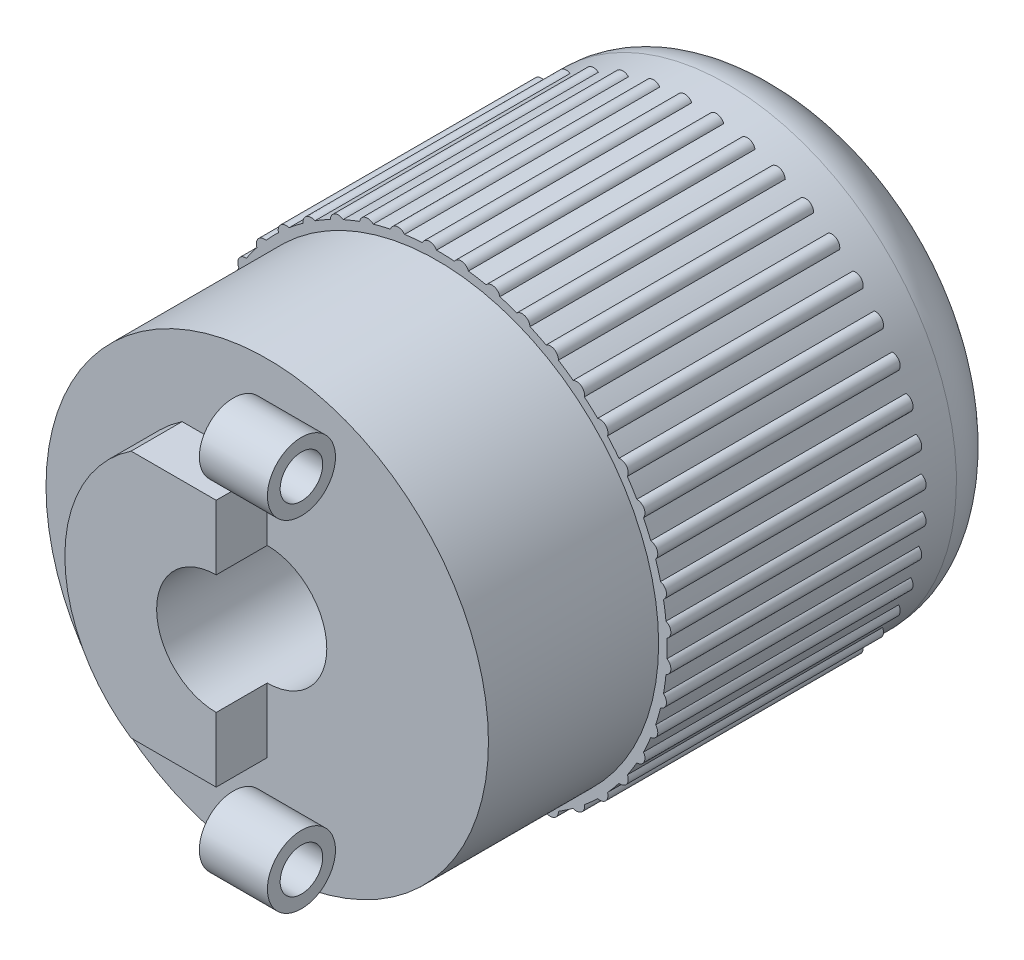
from build123d import *

# Parameters (mm, degrees)
ESQUISSE1_R                  = 13
BASE_EXTRUSION_DEPTH         = 10
ESQUISSE3_R                  = 13.5
BOSS_EXTRU_2_DEPTH           = 17
D_ME1_FACE_RADIUS            = 13.5
D_ME1_HEIGHT                 = 6
BOSS_EXTRU_3_DEPTH           = 15
R_P_TITION_CIRCULAIRE7_COUNT = 45
ESQUISSE5_R                  = 3.5
ENL_V_MAT_EXTRU_1_DEPTH      = 22
ESQUISSE6_R                  = 2
ESQUISSE6_R_2                = 1.25
BOSS_EXTRU_5_DEPTH           = 4
BOSS_EXTRU_7_START           = 3
BOSS_EXTRU_7_DEPTH           = 3


with BuildPart() as part:
    # Esquisse1 → Base-Extrusion (new body)
    with BuildSketch(Plane.XY):
        Circle(ESQUISSE1_R)
    extrude(amount=BASE_EXTRUSION_DEPTH)

    # Esquisse3 → Boss.-Extru.2 (add)
    with BuildSketch(Plane(origin=(0, 0, 0), x_dir=(-1, 0, 0), z_dir=(0, 0, -1))):
        Circle(ESQUISSE3_R)
    extrude(amount=BOSS_EXTRU_2_DEPTH)

    # D_me1: an elliptical dome of height H over a round flat face of radius A is half a spheroid: the quarter ellipse of half axes A and H revolved about the face's axis
    with BuildSketch(Plane((0, 0, -17), x_dir=(0, -1, 0), z_dir=(1, 0, 0)), mode=Mode.PRIVATE) as d_me1_quarter:
        Ellipse(D_ME1_FACE_RADIUS, D_ME1_HEIGHT)
        Rectangle(D_ME1_FACE_RADIUS, D_ME1_HEIGHT, align=(Align.MIN, Align.MIN), mode=Mode.INTERSECT)
    revolve(d_me1_quarter.sketch, axis=Axis((0, 0, -17), (0, 0, -1)))

    # Esquisse4 → Boss.-Extru.3 (add)
    with BuildSketch(Plane.XY):
        with BuildLine():
            ThreePointArc((1.825856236, 13.375957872), (1.43745748, 13.675427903), (0.995279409, 13.463261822))
            ThreePointArc((0.995279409, 13.463261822), (1.394198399, 13.263877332), (1.825856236, 13.375957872))
        make_face()
    boss_extru_3 = extrude(amount=-BOSS_EXTRU_3_DEPTH)

    # R_p_tition circulaire7: Boss.-Extru.3 ×45 about axis
    r_p_tition_circulaire7_axis = Axis((0, 0, 0), (0, 0, 1))
    for i in range(1, R_P_TITION_CIRCULAIRE7_COUNT):
        add(boss_extru_3.rotate(r_p_tition_circulaire7_axis, i * 360 / R_P_TITION_CIRCULAIRE7_COUNT))

    # Esquisse5 → Enl_v. mat.-Extru.1 (cut)
    with BuildSketch(Plane.XY.offset(10)):
        Circle(ESQUISSE5_R)
    extrude(amount=-ENL_V_MAT_EXTRU_1_DEPTH, mode=Mode.SUBTRACT)

    # Esquisse6 → Boss.-Extru.5 (add)
    # profile 1 of 2: a face of its own
    with BuildSketch(Plane(origin=(0, 0, 0), x_dir=(0, 0, -1), z_dir=(1, 0, 0))):
        with Locations((-11.99, 10)):
            Circle(ESQUISSE6_R)
        with Locations((-11.99, 10)):
            Circle(ESQUISSE6_R_2, mode=Mode.SUBTRACT)
    # profile 2 of 2: a face of its own
    with BuildSketch(Plane(origin=(0, 0, 0), x_dir=(0, 0, -1), z_dir=(1, 0, 0))):
        with Locations((-11.99, -10)):
            Circle(ESQUISSE6_R)
        with Locations((-11.99, -10)):
            Circle(ESQUISSE6_R_2, mode=Mode.SUBTRACT)
    extrude(amount=BOSS_EXTRU_5_DEPTH)

    # Esquisse7 → Boss.-Extru.7 (add)
    with BuildSketch(Plane.XY.offset(10).offset(BOSS_EXTRU_7_START)):
        with BuildLine():
            Line((0, 3.5), (0, 7.3))
            Line((0, 7.3), (-5, 7.3))
            ThreePointArc((-5, 7.3), (-8.892833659, 0), (-5, -7.3))
            Line((-5, -7.3), (0, -7.3))
            Line((0, -7.3), (0, -3.5))
            ThreePointArc((0, -3.5), (-3.5, 0), (0, 3.5))
        make_face()
    extrude(amount=-BOSS_EXTRU_7_DEPTH)


solid = part.part
